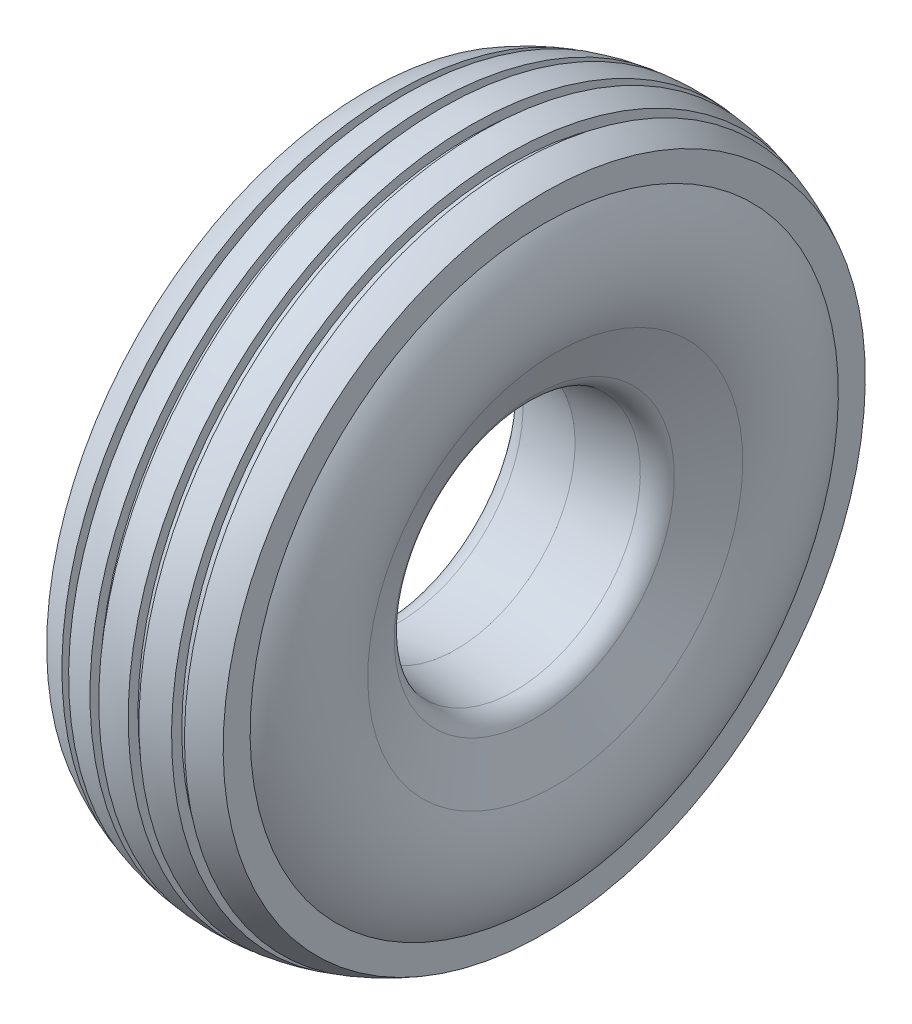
ISO-10303-21;
HEADER;
FILE_DESCRIPTION(('STEP AP214'),'2;1');
FILE_NAME('part.step','',(''),(''),'','','');
FILE_SCHEMA(('AUTOMOTIVE_DESIGN { 1 0 10303 214 1 1 1 1 }'));
ENDSEC;
DATA;
#1=APPLICATION_CONTEXT('core data for automotive mechanical design processes');
#2=APPLICATION_PROTOCOL_DEFINITION('international standard','automotive_design',2000,#1);
#3=PRODUCT_CONTEXT('',#1,'mechanical');
#4=PRODUCT('Part','Part','',(#3));
#5=PRODUCT_RELATED_PRODUCT_CATEGORY('part','',(#4));
#6=PRODUCT_DEFINITION_FORMATION('','',#4);
#7=PRODUCT_DEFINITION_CONTEXT('part definition',#1,'design');
#8=PRODUCT_DEFINITION('design','',#6,#7);
#9=PRODUCT_DEFINITION_SHAPE('','',#8);
#10=(LENGTH_UNIT() NAMED_UNIT(*) SI_UNIT(.MILLI.,.METRE.));
#11=(NAMED_UNIT(*) PLANE_ANGLE_UNIT() SI_UNIT($,.RADIAN.));
#12=(NAMED_UNIT(*) SI_UNIT($,.STERADIAN.) SOLID_ANGLE_UNIT());
#13=UNCERTAINTY_MEASURE_WITH_UNIT(LENGTH_MEASURE(1.E-05),#10,'distance_accuracy_value','');
#14=(GEOMETRIC_REPRESENTATION_CONTEXT(3) GLOBAL_UNCERTAINTY_ASSIGNED_CONTEXT((#13)) GLOBAL_UNIT_ASSIGNED_CONTEXT((#10,
#11,#12)) REPRESENTATION_CONTEXT('',''));
#15=CARTESIAN_POINT('',(0.,0.,0.));
#16=DIRECTION('',(0.,0.,1.));
#17=DIRECTION('',(1.,0.,0.));
#18=AXIS2_PLACEMENT_3D('',#15,#16,#17);
#19=CARTESIAN_POINT('',(-0.184596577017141,0.,0.));
#20=DIRECTION('',(1.,0.,0.));
#21=DIRECTION('',(0.,1.,0.));
#22=AXIS2_PLACEMENT_3D('',#19,#20,#21);
#23=TOROIDAL_SURFACE('',#22,47.1656479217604,21.9569850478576);
#24=CARTESIAN_POINT('',(-20.25,0.,0.));
#25=DIRECTION('',(1.,0.,0.));
#26=DIRECTION('',(0.,1.,0.));
#27=AXIS2_PLACEMENT_3D('',#24,#25,#26);
#28=CIRCLE('',#27,38.25);
#29=CARTESIAN_POINT('',(-20.25,38.25,0.));
#30=VERTEX_POINT('',#29);
#31=EDGE_CURVE('E159',#30,#30,#28,.T.);
#32=ORIENTED_EDGE('',*,*,#31,.T.);
#33=EDGE_LOOP('',(#32));
#34=FACE_BOUND('',#33,.T.);
#35=CARTESIAN_POINT('',(-18.,0.,0.));
#36=DIRECTION('',(1.,0.,0.));
#37=DIRECTION('',(0.,1.,0.));
#38=AXIS2_PLACEMENT_3D('',#35,#36,#37);
#39=CIRCLE('',#38,60.);
#40=CARTESIAN_POINT('',(-18.,60.,0.));
#41=VERTEX_POINT('',#40);
#42=EDGE_CURVE('E81',#41,#41,#39,.T.);
#43=ORIENTED_EDGE('',*,*,#42,.F.);
#44=EDGE_LOOP('',(#43));
#45=FACE_BOUND('',#44,.T.);
#46=ADVANCED_FACE('F45',(#34,#45),#23,.T.);
#47=CARTESIAN_POINT('',(-18.,60.,0.));
#48=DIRECTION('',(-1.,0.,0.));
#49=DIRECTION('',(0.,-1.,0.));
#50=AXIS2_PLACEMENT_3D('',#47,#48,#49);
#51=PLANE('',#50);
#52=ORIENTED_EDGE('',*,*,#42,.T.);
#53=EDGE_LOOP('',(#52));
#54=FACE_BOUND('',#53,.T.);
#55=CARTESIAN_POINT('',(-18.,0.,0.));
#56=DIRECTION('',(1.,0.,0.));
#57=DIRECTION('',(0.,1.,0.));
#58=AXIS2_PLACEMENT_3D('',#55,#56,#57);
#59=CIRCLE('',#58,65.5);
#60=CARTESIAN_POINT('',(-18.,65.5,0.));
#61=VERTEX_POINT('',#60);
#62=EDGE_CURVE('E84',#61,#61,#59,.T.);
#63=ORIENTED_EDGE('',*,*,#62,.F.);
#64=EDGE_LOOP('',(#63));
#65=FACE_BOUND('',#64,.T.);
#66=ADVANCED_FACE('F178',(#54,#65),#51,.T.);
#67=CARTESIAN_POINT('',(0.,0.,0.));
#68=DIRECTION('',(1.,0.,0.));
#69=DIRECTION('',(0.,1.,0.));
#70=AXIS2_PLACEMENT_3D('',#67,#68,#69);
#71=DEGENERATE_TOROIDAL_SURFACE('',#70,31.7500000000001,38.25,.T.);
#72=ORIENTED_EDGE('',*,*,#62,.T.);
#73=EDGE_LOOP('',(#72));
#74=FACE_BOUND('',#73,.T.);
#75=CARTESIAN_POINT('',(-12.5,0.,0.));
#76=DIRECTION('',(1.,0.,0.));
#77=DIRECTION('',(0.,1.,0.));
#78=AXIS2_PLACEMENT_3D('',#75,#76,#77);
#79=CIRCLE('',#78,67.899861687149);
#80=CARTESIAN_POINT('',(-12.5,67.899861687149,0.));
#81=VERTEX_POINT('',#80);
#82=EDGE_CURVE('E87',#81,#81,#79,.T.);
#83=ORIENTED_EDGE('',*,*,#82,.F.);
#84=EDGE_LOOP('',(#83));
#85=FACE_BOUND('',#84,.T.);
#86=ADVANCED_FACE('F183',(#74,#85),#71,.T.);
#87=CARTESIAN_POINT('',(-12.5,67.899861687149,0.));
#88=DIRECTION('',(1.,0.,0.));
#89=DIRECTION('',(0.,1.,0.));
#90=AXIS2_PLACEMENT_3D('',#87,#88,#89);
#91=PLANE('',#90);
#92=ORIENTED_EDGE('',*,*,#82,.T.);
#93=EDGE_LOOP('',(#92));
#94=FACE_BOUND('',#93,.T.);
#95=CARTESIAN_POINT('',(-12.5,0.,0.));
#96=DIRECTION('',(1.,0.,0.));
#97=DIRECTION('',(0.,1.,0.));
#98=AXIS2_PLACEMENT_3D('',#95,#96,#97);
#99=CIRCLE('',#98,65.7766439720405);
#100=CARTESIAN_POINT('',(-12.5,65.7766439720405,0.));
#101=VERTEX_POINT('',#100);
#102=EDGE_CURVE('E90',#101,#101,#99,.T.);
#103=ORIENTED_EDGE('',*,*,#102,.F.);
#104=EDGE_LOOP('',(#103));
#105=FACE_BOUND('',#104,.T.);
#106=ADVANCED_FACE('F503',(#94,#105),#91,.T.);
#107=CARTESIAN_POINT('',(0.,0.,0.));
#108=DIRECTION('',(1.,0.,0.));
#109=DIRECTION('',(0.,1.,0.));
#110=AXIS2_PLACEMENT_3D('',#107,#108,#109);
#111=DEGENERATE_TOROIDAL_SURFACE('',#110,31.7500000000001,36.25,.T.);
#112=ORIENTED_EDGE('',*,*,#102,.T.);
#113=EDGE_LOOP('',(#112));
#114=FACE_BOUND('',#113,.T.);
#115=CARTESIAN_POINT('',(-10.5,0.,0.));
#116=DIRECTION('',(1.,0.,0.));
#117=DIRECTION('',(0.,1.,0.));
#118=AXIS2_PLACEMENT_3D('',#115,#116,#117);
#119=CIRCLE('',#118,66.4460012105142);
#120=CARTESIAN_POINT('',(-10.5,66.4460012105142,0.));
#121=VERTEX_POINT('',#120);
#122=EDGE_CURVE('E93',#121,#121,#119,.T.);
#123=ORIENTED_EDGE('',*,*,#122,.F.);
#124=EDGE_LOOP('',(#123));
#125=FACE_BOUND('',#124,.T.);
#126=ADVANCED_FACE('F493',(#114,#125),#111,.T.);
#127=CARTESIAN_POINT('',(-10.5,68.5305995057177,0.));
#128=DIRECTION('',(-1.,0.,0.));
#129=DIRECTION('',(0.,-1.,0.));
#130=AXIS2_PLACEMENT_3D('',#127,#128,#129);
#131=PLANE('',#130);
#132=ORIENTED_EDGE('',*,*,#122,.T.);
#133=EDGE_LOOP('',(#132));
#134=FACE_BOUND('',#133,.T.);
#135=CARTESIAN_POINT('',(-10.5,0.,0.));
#136=DIRECTION('',(1.,0.,0.));
#137=DIRECTION('',(0.,1.,0.));
#138=AXIS2_PLACEMENT_3D('',#135,#136,#137);
#139=CIRCLE('',#138,68.5305995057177);
#140=CARTESIAN_POINT('',(-10.5,68.5305995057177,0.));
#141=VERTEX_POINT('',#140);
#142=EDGE_CURVE('E96',#141,#141,#139,.T.);
#143=ORIENTED_EDGE('',*,*,#142,.F.);
#144=EDGE_LOOP('',(#143));
#145=FACE_BOUND('',#144,.T.);
#146=ADVANCED_FACE('F483',(#134,#145),#131,.T.);
#147=CARTESIAN_POINT('',(0.,0.,0.));
#148=DIRECTION('',(1.,0.,0.));
#149=DIRECTION('',(0.,1.,0.));
#150=AXIS2_PLACEMENT_3D('',#147,#148,#149);
#151=DEGENERATE_TOROIDAL_SURFACE('',#150,31.7500000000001,38.25,.T.);
#152=ORIENTED_EDGE('',*,*,#142,.T.);
#153=EDGE_LOOP('',(#152));
#154=FACE_BOUND('',#153,.T.);
#155=CARTESIAN_POINT('',(-5.00000000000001,0.,0.));
#156=DIRECTION('',(1.,0.,0.));
#157=DIRECTION('',(0.,1.,0.));
#158=AXIS2_PLACEMENT_3D('',#155,#156,#157);
#159=CIRCLE('',#158,69.6717945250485);
#160=CARTESIAN_POINT('',(-5.00000000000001,69.6717945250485,0.));
#161=VERTEX_POINT('',#160);
#162=EDGE_CURVE('E99',#161,#161,#159,.T.);
#163=ORIENTED_EDGE('',*,*,#162,.F.);
#164=EDGE_LOOP('',(#163));
#165=FACE_BOUND('',#164,.T.);
#166=ADVANCED_FACE('F473',(#154,#165),#151,.T.);
#167=CARTESIAN_POINT('',(-5.00000000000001,69.6717945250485,0.));
#168=DIRECTION('',(1.,0.,0.));
#169=DIRECTION('',(0.,1.,0.));
#170=AXIS2_PLACEMENT_3D('',#167,#168,#169);
#171=PLANE('',#170);
#172=ORIENTED_EDGE('',*,*,#162,.T.);
#173=EDGE_LOOP('',(#172));
#174=FACE_BOUND('',#173,.T.);
#175=CARTESIAN_POINT('',(-5.00000000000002,0.,0.));
#176=DIRECTION('',(1.,0.,0.));
#177=DIRECTION('',(0.,1.,0.));
#178=AXIS2_PLACEMENT_3D('',#175,#176,#177);
#179=CIRCLE('',#178,67.6535165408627);
#180=CARTESIAN_POINT('',(-5.00000000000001,67.6535165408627,0.));
#181=VERTEX_POINT('',#180);
#182=EDGE_CURVE('E102',#181,#181,#179,.T.);
#183=ORIENTED_EDGE('',*,*,#182,.F.);
#184=EDGE_LOOP('',(#183));
#185=FACE_BOUND('',#184,.T.);
#186=ADVANCED_FACE('F463',(#174,#185),#171,.T.);
#187=CARTESIAN_POINT('',(0.,0.,0.));
#188=DIRECTION('',(1.,0.,0.));
#189=DIRECTION('',(0.,1.,0.));
#190=AXIS2_PLACEMENT_3D('',#187,#188,#189);
#191=DEGENERATE_TOROIDAL_SURFACE('',#190,31.7500000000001,36.25,.T.);
#192=ORIENTED_EDGE('',*,*,#182,.T.);
#193=EDGE_LOOP('',(#192));
#194=FACE_BOUND('',#193,.T.);
#195=CARTESIAN_POINT('',(-3.00000000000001,0.,0.));
#196=DIRECTION('',(1.,0.,0.));
#197=DIRECTION('',(0.,1.,0.));
#198=AXIS2_PLACEMENT_3D('',#195,#196,#197);
#199=CIRCLE('',#198,67.8756487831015);
#200=CARTESIAN_POINT('',(-3.00000000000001,67.8756487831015,0.));
#201=VERTEX_POINT('',#200);
#202=EDGE_CURVE('E105',#201,#201,#199,.T.);
#203=ORIENTED_EDGE('',*,*,#202,.F.);
#204=EDGE_LOOP('',(#203));
#205=FACE_BOUND('',#204,.T.);
#206=ADVANCED_FACE('F453',(#194,#205),#191,.T.);
#207=CARTESIAN_POINT('',(-3.00000000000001,69.8821714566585,0.));
#208=DIRECTION('',(-1.,0.,0.));
#209=DIRECTION('',(0.,-1.,0.));
#210=AXIS2_PLACEMENT_3D('',#207,#208,#209);
#211=PLANE('',#210);
#212=ORIENTED_EDGE('',*,*,#202,.T.);
#213=EDGE_LOOP('',(#212));
#214=FACE_BOUND('',#213,.T.);
#215=CARTESIAN_POINT('',(-3.00000000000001,0.,0.));
#216=DIRECTION('',(1.,0.,0.));
#217=DIRECTION('',(0.,1.,0.));
#218=AXIS2_PLACEMENT_3D('',#215,#216,#217);
#219=CIRCLE('',#218,69.8821714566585);
#220=CARTESIAN_POINT('',(-3.00000000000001,69.8821714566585,0.));
#221=VERTEX_POINT('',#220);
#222=EDGE_CURVE('E108',#221,#221,#219,.T.);
#223=ORIENTED_EDGE('',*,*,#222,.F.);
#224=EDGE_LOOP('',(#223));
#225=FACE_BOUND('',#224,.T.);
#226=ADVANCED_FACE('F443',(#214,#225),#211,.T.);
#227=CARTESIAN_POINT('',(0.,0.,0.));
#228=DIRECTION('',(1.,0.,0.));
#229=DIRECTION('',(0.,1.,0.));
#230=AXIS2_PLACEMENT_3D('',#227,#228,#229);
#231=DEGENERATE_TOROIDAL_SURFACE('',#230,31.7500000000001,38.25,.T.);
#232=ORIENTED_EDGE('',*,*,#222,.T.);
#233=EDGE_LOOP('',(#232));
#234=FACE_BOUND('',#233,.T.);
#235=CARTESIAN_POINT('',(2.99999999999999,0.,0.));
#236=DIRECTION('',(1.,0.,0.));
#237=DIRECTION('',(0.,1.,0.));
#238=AXIS2_PLACEMENT_3D('',#235,#236,#237);
#239=CIRCLE('',#238,69.8821714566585);
#240=CARTESIAN_POINT('',(3.,69.8821714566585,0.));
#241=VERTEX_POINT('',#240);
#242=EDGE_CURVE('E111',#241,#241,#239,.T.);
#243=ORIENTED_EDGE('',*,*,#242,.F.);
#244=EDGE_LOOP('',(#243));
#245=FACE_BOUND('',#244,.T.);
#246=ADVANCED_FACE('F433',(#234,#245),#231,.T.);
#247=CARTESIAN_POINT('',(3.,69.8821714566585,0.));
#248=DIRECTION('',(1.,0.,0.));
#249=DIRECTION('',(0.,1.,0.));
#250=AXIS2_PLACEMENT_3D('',#247,#248,#249);
#251=PLANE('',#250);
#252=ORIENTED_EDGE('',*,*,#242,.T.);
#253=EDGE_LOOP('',(#252));
#254=FACE_BOUND('',#253,.T.);
#255=CARTESIAN_POINT('',(2.99999999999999,0.,0.));
#256=DIRECTION('',(1.,0.,0.));
#257=DIRECTION('',(0.,1.,0.));
#258=AXIS2_PLACEMENT_3D('',#255,#256,#257);
#259=CIRCLE('',#258,67.8756487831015);
#260=CARTESIAN_POINT('',(3.,67.8756487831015,0.));
#261=VERTEX_POINT('',#260);
#262=EDGE_CURVE('E114',#261,#261,#259,.T.);
#263=ORIENTED_EDGE('',*,*,#262,.F.);
#264=EDGE_LOOP('',(#263));
#265=FACE_BOUND('',#264,.T.);
#266=ADVANCED_FACE('F423',(#254,#265),#251,.T.);
#267=CARTESIAN_POINT('',(0.,0.,0.));
#268=DIRECTION('',(1.,0.,0.));
#269=DIRECTION('',(0.,1.,0.));
#270=AXIS2_PLACEMENT_3D('',#267,#268,#269);
#271=DEGENERATE_TOROIDAL_SURFACE('',#270,31.7500000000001,36.25,.T.);
#272=ORIENTED_EDGE('',*,*,#262,.T.);
#273=EDGE_LOOP('',(#272));
#274=FACE_BOUND('',#273,.T.);
#275=CARTESIAN_POINT('',(4.99999999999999,0.,0.));
#276=DIRECTION('',(1.,0.,0.));
#277=DIRECTION('',(0.,1.,0.));
#278=AXIS2_PLACEMENT_3D('',#275,#276,#277);
#279=CIRCLE('',#278,67.6535165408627);
#280=CARTESIAN_POINT('',(4.99999999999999,67.6535165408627,0.));
#281=VERTEX_POINT('',#280);
#282=EDGE_CURVE('E117',#281,#281,#279,.T.);
#283=ORIENTED_EDGE('',*,*,#282,.F.);
#284=EDGE_LOOP('',(#283));
#285=FACE_BOUND('',#284,.T.);
#286=ADVANCED_FACE('F413',(#274,#285),#271,.T.);
#287=CARTESIAN_POINT('',(4.99999999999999,69.6717945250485,0.));
#288=DIRECTION('',(-1.,0.,0.));
#289=DIRECTION('',(0.,-1.,0.));
#290=AXIS2_PLACEMENT_3D('',#287,#288,#289);
#291=PLANE('',#290);
#292=ORIENTED_EDGE('',*,*,#282,.T.);
#293=EDGE_LOOP('',(#292));
#294=FACE_BOUND('',#293,.T.);
#295=CARTESIAN_POINT('',(4.99999999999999,0.,0.));
#296=DIRECTION('',(1.,0.,0.));
#297=DIRECTION('',(0.,1.,0.));
#298=AXIS2_PLACEMENT_3D('',#295,#296,#297);
#299=CIRCLE('',#298,69.6717945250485);
#300=CARTESIAN_POINT('',(4.99999999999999,69.6717945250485,0.));
#301=VERTEX_POINT('',#300);
#302=EDGE_CURVE('E120',#301,#301,#299,.T.);
#303=ORIENTED_EDGE('',*,*,#302,.F.);
#304=EDGE_LOOP('',(#303));
#305=FACE_BOUND('',#304,.T.);
#306=ADVANCED_FACE('F403',(#294,#305),#291,.T.);
#307=CARTESIAN_POINT('',(0.,0.,0.));
#308=DIRECTION('',(1.,0.,0.));
#309=DIRECTION('',(0.,1.,0.));
#310=AXIS2_PLACEMENT_3D('',#307,#308,#309);
#311=DEGENERATE_TOROIDAL_SURFACE('',#310,31.7500000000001,38.25,.T.);
#312=ORIENTED_EDGE('',*,*,#302,.T.);
#313=EDGE_LOOP('',(#312));
#314=FACE_BOUND('',#313,.T.);
#315=CARTESIAN_POINT('',(10.5,0.,0.));
#316=DIRECTION('',(1.,0.,0.));
#317=DIRECTION('',(0.,1.,0.));
#318=AXIS2_PLACEMENT_3D('',#315,#316,#317);
#319=CIRCLE('',#318,68.5305995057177);
#320=CARTESIAN_POINT('',(10.5,68.5305995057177,0.));
#321=VERTEX_POINT('',#320);
#322=EDGE_CURVE('E123',#321,#321,#319,.T.);
#323=ORIENTED_EDGE('',*,*,#322,.F.);
#324=EDGE_LOOP('',(#323));
#325=FACE_BOUND('',#324,.T.);
#326=ADVANCED_FACE('F393',(#314,#325),#311,.T.);
#327=CARTESIAN_POINT('',(10.5,68.5305995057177,0.));
#328=DIRECTION('',(1.,0.,0.));
#329=DIRECTION('',(0.,1.,0.));
#330=AXIS2_PLACEMENT_3D('',#327,#328,#329);
#331=PLANE('',#330);
#332=ORIENTED_EDGE('',*,*,#322,.T.);
#333=EDGE_LOOP('',(#332));
#334=FACE_BOUND('',#333,.T.);
#335=CARTESIAN_POINT('',(10.5,0.,0.));
#336=DIRECTION('',(1.,0.,0.));
#337=DIRECTION('',(0.,1.,0.));
#338=AXIS2_PLACEMENT_3D('',#335,#336,#337);
#339=CIRCLE('',#338,66.4460012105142);
#340=CARTESIAN_POINT('',(10.5,66.4460012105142,0.));
#341=VERTEX_POINT('',#340);
#342=EDGE_CURVE('E126',#341,#341,#339,.T.);
#343=ORIENTED_EDGE('',*,*,#342,.F.);
#344=EDGE_LOOP('',(#343));
#345=FACE_BOUND('',#344,.T.);
#346=ADVANCED_FACE('F383',(#334,#345),#331,.T.);
#347=CARTESIAN_POINT('',(0.,0.,0.));
#348=DIRECTION('',(1.,0.,0.));
#349=DIRECTION('',(0.,1.,0.));
#350=AXIS2_PLACEMENT_3D('',#347,#348,#349);
#351=DEGENERATE_TOROIDAL_SURFACE('',#350,31.7500000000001,36.25,.T.);
#352=ORIENTED_EDGE('',*,*,#342,.T.);
#353=EDGE_LOOP('',(#352));
#354=FACE_BOUND('',#353,.T.);
#355=CARTESIAN_POINT('',(12.5,0.,0.));
#356=DIRECTION('',(1.,0.,0.));
#357=DIRECTION('',(0.,1.,0.));
#358=AXIS2_PLACEMENT_3D('',#355,#356,#357);
#359=CIRCLE('',#358,65.7766439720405);
#360=CARTESIAN_POINT('',(12.5,65.7766439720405,0.));
#361=VERTEX_POINT('',#360);
#362=EDGE_CURVE('E129',#361,#361,#359,.T.);
#363=ORIENTED_EDGE('',*,*,#362,.F.);
#364=EDGE_LOOP('',(#363));
#365=FACE_BOUND('',#364,.T.);
#366=ADVANCED_FACE('F373',(#354,#365),#351,.T.);
#367=CARTESIAN_POINT('',(12.5,67.899861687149,0.));
#368=DIRECTION('',(-1.,0.,0.));
#369=DIRECTION('',(0.,-1.,0.));
#370=AXIS2_PLACEMENT_3D('',#367,#368,#369);
#371=PLANE('',#370);
#372=ORIENTED_EDGE('',*,*,#362,.T.);
#373=EDGE_LOOP('',(#372));
#374=FACE_BOUND('',#373,.T.);
#375=CARTESIAN_POINT('',(12.5,0.,0.));
#376=DIRECTION('',(1.,0.,0.));
#377=DIRECTION('',(0.,1.,0.));
#378=AXIS2_PLACEMENT_3D('',#375,#376,#377);
#379=CIRCLE('',#378,67.899861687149);
#380=CARTESIAN_POINT('',(12.5,67.899861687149,0.));
#381=VERTEX_POINT('',#380);
#382=EDGE_CURVE('E132',#381,#381,#379,.T.);
#383=ORIENTED_EDGE('',*,*,#382,.F.);
#384=EDGE_LOOP('',(#383));
#385=FACE_BOUND('',#384,.T.);
#386=ADVANCED_FACE('F363',(#374,#385),#371,.T.);
#387=CARTESIAN_POINT('',(0.,0.,0.));
#388=DIRECTION('',(1.,0.,0.));
#389=DIRECTION('',(0.,1.,0.));
#390=AXIS2_PLACEMENT_3D('',#387,#388,#389);
#391=DEGENERATE_TOROIDAL_SURFACE('',#390,31.7500000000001,38.25,.T.);
#392=ORIENTED_EDGE('',*,*,#382,.T.);
#393=EDGE_LOOP('',(#392));
#394=FACE_BOUND('',#393,.T.);
#395=CARTESIAN_POINT('',(18.,0.,0.));
#396=DIRECTION('',(1.,0.,0.));
#397=DIRECTION('',(0.,1.,0.));
#398=AXIS2_PLACEMENT_3D('',#395,#396,#397);
#399=CIRCLE('',#398,65.5);
#400=CARTESIAN_POINT('',(18.,65.5,0.));
#401=VERTEX_POINT('',#400);
#402=EDGE_CURVE('E135',#401,#401,#399,.T.);
#403=ORIENTED_EDGE('',*,*,#402,.F.);
#404=EDGE_LOOP('',(#403));
#405=FACE_BOUND('',#404,.T.);
#406=ADVANCED_FACE('F353',(#394,#405),#391,.T.);
#407=CARTESIAN_POINT('',(18.,60.,0.));
#408=DIRECTION('',(1.,0.,0.));
#409=DIRECTION('',(0.,1.,0.));
#410=AXIS2_PLACEMENT_3D('',#407,#408,#409);
#411=PLANE('',#410);
#412=ORIENTED_EDGE('',*,*,#402,.T.);
#413=EDGE_LOOP('',(#412));
#414=FACE_BOUND('',#413,.T.);
#415=CARTESIAN_POINT('',(18.,0.,0.));
#416=DIRECTION('',(1.,0.,0.));
#417=DIRECTION('',(0.,1.,0.));
#418=AXIS2_PLACEMENT_3D('',#415,#416,#417);
#419=CIRCLE('',#418,60.);
#420=CARTESIAN_POINT('',(18.,60.,0.));
#421=VERTEX_POINT('',#420);
#422=EDGE_CURVE('E138',#421,#421,#419,.T.);
#423=ORIENTED_EDGE('',*,*,#422,.F.);
#424=EDGE_LOOP('',(#423));
#425=FACE_BOUND('',#424,.T.);
#426=ADVANCED_FACE('F343',(#414,#425),#411,.T.);
#427=CARTESIAN_POINT('',(0.184596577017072,0.,0.));
#428=DIRECTION('',(1.,0.,0.));
#429=DIRECTION('',(0.,1.,0.));
#430=AXIS2_PLACEMENT_3D('',#427,#428,#429);
#431=TOROIDAL_SURFACE('',#430,47.1656479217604,21.9569850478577);
#432=ORIENTED_EDGE('',*,*,#422,.T.);
#433=EDGE_LOOP('',(#432));
#434=FACE_BOUND('',#433,.T.);
#435=CARTESIAN_POINT('',(20.25,0.,0.));
#436=DIRECTION('',(1.,0.,0.));
#437=DIRECTION('',(0.,1.,0.));
#438=AXIS2_PLACEMENT_3D('',#435,#436,#437);
#439=CIRCLE('',#438,38.25);
#440=CARTESIAN_POINT('',(20.25,38.25,0.));
#441=VERTEX_POINT('',#440);
#442=EDGE_CURVE('E141',#441,#441,#439,.T.);
#443=ORIENTED_EDGE('',*,*,#442,.F.);
#444=EDGE_LOOP('',(#443));
#445=FACE_BOUND('',#444,.T.);
#446=ADVANCED_FACE('F333',(#434,#445),#431,.T.);
#447=CARTESIAN_POINT('',(15.9587088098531,0.,0.));
#448=DIRECTION('',(1.,0.,0.));
#449=DIRECTION('',(0.,1.,0.));
#450=AXIS2_PLACEMENT_3D('',#447,#448,#449);
#451=CONICAL_SURFACE('',#450,28.5920940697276,1.15266810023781);
#452=ORIENTED_EDGE('',*,*,#442,.T.);
#453=EDGE_LOOP('',(#452));
#454=FACE_BOUND('',#453,.T.);
#455=CARTESIAN_POINT('',(15.9587088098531,0.,0.));
#456=DIRECTION('',(1.,0.,0.));
#457=DIRECTION('',(0.,1.,0.));
#458=AXIS2_PLACEMENT_3D('',#455,#456,#457);
#459=CIRCLE('',#458,28.5920940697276);
#460=CARTESIAN_POINT('',(15.9587088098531,28.5920940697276,0.));
#461=VERTEX_POINT('',#460);
#462=EDGE_CURVE('E144',#461,#461,#459,.T.);
#463=ORIENTED_EDGE('',*,*,#462,.F.);
#464=EDGE_LOOP('',(#463));
#465=FACE_BOUND('',#464,.T.);
#466=ADVANCED_FACE('F323',(#454,#465),#451,.F.);
#467=CARTESIAN_POINT('',(11.3894559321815,0.,0.));
#468=DIRECTION('',(1.,0.,0.));
#469=DIRECTION('',(0.,1.,0.));
#470=AXIS2_PLACEMENT_3D('',#467,#468,#469);
#471=TOROIDAL_SURFACE('',#470,30.6223472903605,5.);
#472=ORIENTED_EDGE('',*,*,#462,.T.);
#473=EDGE_LOOP('',(#472));
#474=FACE_BOUND('',#473,.T.);
#475=CARTESIAN_POINT('',(11.9523266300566,0.,0.));
#476=DIRECTION('',(1.,0.,0.));
#477=DIRECTION('',(0.,1.,0.));
#478=AXIS2_PLACEMENT_3D('',#475,#476,#477);
#479=CIRCLE('',#478,25.6541306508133);
#480=CARTESIAN_POINT('',(11.9523266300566,25.6541306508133,0.));
#481=VERTEX_POINT('',#480);
#482=EDGE_CURVE('E147',#481,#481,#479,.T.);
#483=ORIENTED_EDGE('',*,*,#482,.F.);
#484=EDGE_LOOP('',(#483));
#485=FACE_BOUND('',#484,.T.);
#486=ADVANCED_FACE('F313',(#474,#485),#471,.T.);
#487=CARTESIAN_POINT('',(0.,0.,0.));
#488=DIRECTION('',(1.,0.,0.));
#489=DIRECTION('',(0.,1.,0.));
#490=AXIS2_PLACEMENT_3D('',#487,#488,#489);
#491=CONICAL_SURFACE('',#490,24.3,0.1128132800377);
#492=ORIENTED_EDGE('',*,*,#482,.T.);
#493=EDGE_LOOP('',(#492));
#494=FACE_BOUND('',#493,.T.);
#495=CARTESIAN_POINT('',(0.,0.,0.));
#496=DIRECTION('',(1.,0.,0.));
#497=DIRECTION('',(0.,1.,0.));
#498=AXIS2_PLACEMENT_3D('',#495,#496,#497);
#499=CIRCLE('',#498,24.3);
#500=CARTESIAN_POINT('',(0.,24.3,0.));
#501=VERTEX_POINT('',#500);
#502=EDGE_CURVE('E150',#501,#501,#499,.T.);
#503=ORIENTED_EDGE('',*,*,#502,.F.);
#504=EDGE_LOOP('',(#503));
#505=FACE_BOUND('',#504,.T.);
#506=ADVANCED_FACE('F303',(#494,#505),#491,.F.);
#507=CARTESIAN_POINT('',(-11.9523266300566,0.,0.));
#508=DIRECTION('',(-1.,0.,0.));
#509=DIRECTION('',(0.,-1.,0.));
#510=AXIS2_PLACEMENT_3D('',#507,#508,#509);
#511=CONICAL_SURFACE('',#510,25.6541306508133,0.112813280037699);
#512=ORIENTED_EDGE('',*,*,#502,.T.);
#513=EDGE_LOOP('',(#512));
#514=FACE_BOUND('',#513,.T.);
#515=CARTESIAN_POINT('',(-11.9523266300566,0.,0.));
#516=DIRECTION('',(1.,0.,0.));
#517=DIRECTION('',(0.,1.,0.));
#518=AXIS2_PLACEMENT_3D('',#515,#516,#517);
#519=CIRCLE('',#518,25.6541306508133);
#520=CARTESIAN_POINT('',(-11.9523266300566,25.6541306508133,0.));
#521=VERTEX_POINT('',#520);
#522=EDGE_CURVE('E153',#521,#521,#519,.T.);
#523=ORIENTED_EDGE('',*,*,#522,.F.);
#524=EDGE_LOOP('',(#523));
#525=FACE_BOUND('',#524,.T.);
#526=ADVANCED_FACE('F174',(#514,#525),#511,.F.);
#527=CARTESIAN_POINT('',(-11.3894559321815,0.,0.));
#528=DIRECTION('',(1.,0.,0.));
#529=DIRECTION('',(0.,1.,0.));
#530=AXIS2_PLACEMENT_3D('',#527,#528,#529);
#531=TOROIDAL_SURFACE('',#530,30.6223472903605,5.);
#532=ORIENTED_EDGE('',*,*,#522,.T.);
#533=EDGE_LOOP('',(#532));
#534=FACE_BOUND('',#533,.T.);
#535=CARTESIAN_POINT('',(-15.9587088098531,0.,0.));
#536=DIRECTION('',(1.,0.,0.));
#537=DIRECTION('',(0.,1.,0.));
#538=AXIS2_PLACEMENT_3D('',#535,#536,#537);
#539=CIRCLE('',#538,28.5920940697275);
#540=CARTESIAN_POINT('',(-15.9587088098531,28.5920940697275,0.));
#541=VERTEX_POINT('',#540);
#542=EDGE_CURVE('E156',#541,#541,#539,.T.);
#543=ORIENTED_EDGE('',*,*,#542,.F.);
#544=EDGE_LOOP('',(#543));
#545=FACE_BOUND('',#544,.T.);
#546=ADVANCED_FACE('F167',(#534,#545),#531,.T.);
#547=CARTESIAN_POINT('',(-20.25,0.,0.));
#548=DIRECTION('',(-1.,0.,0.));
#549=DIRECTION('',(0.,-1.,0.));
#550=AXIS2_PLACEMENT_3D('',#547,#548,#549);
#551=CONICAL_SURFACE('',#550,38.25,1.15266810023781);
#552=ORIENTED_EDGE('',*,*,#542,.T.);
#553=EDGE_LOOP('',(#552));
#554=FACE_BOUND('',#553,.T.);
#555=ORIENTED_EDGE('',*,*,#31,.F.);
#556=EDGE_LOOP('',(#555));
#557=FACE_BOUND('',#556,.T.);
#558=ADVANCED_FACE('F165',(#554,#557),#551,.F.);
#559=CLOSED_SHELL('',(#46,#66,#86,#106,#126,#146,#166,#186,#206,#226,#246,#266,#286,#306,#326,
#346,#366,#386,#406,#426,#446,#466,#486,#506,#526,#546,#558));
#560=CARTESIAN_POINT('',(-0.184596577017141,0.,0.));
#561=DIRECTION('',(1.,0.,0.));
#562=DIRECTION('',(0.,1.,0.));
#563=AXIS2_PLACEMENT_3D('',#560,#561,#562);
#564=TOROIDAL_SURFACE('',#563,47.1656479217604,15.9569850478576);
#565=CARTESIAN_POINT('',(-14.7668965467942,0.,0.));
#566=DIRECTION('',(1.,0.,0.));
#567=DIRECTION('',(0.,1.,0.));
#568=AXIS2_PLACEMENT_3D('',#565,#566,#567);
#569=CIRCLE('',#568,40.6863038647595);
#570=CARTESIAN_POINT('',(-14.7668965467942,40.6863038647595,0.));
#571=VERTEX_POINT('',#570);
#572=EDGE_CURVE('E12',#571,#571,#569,.T.);
#573=ORIENTED_EDGE('',*,*,#572,.F.);
#574=EDGE_LOOP('',(#573));
#575=FACE_BOUND('',#574,.T.);
#576=CARTESIAN_POINT('',(-12.,0.,0.));
#577=DIRECTION('',(1.,0.,0.));
#578=DIRECTION('',(0.,1.,0.));
#579=AXIS2_PLACEMENT_3D('',#576,#577,#578);
#580=CIRCLE('',#579,57.8904609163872);
#581=CARTESIAN_POINT('',(-12.,57.8904609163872,0.));
#582=VERTEX_POINT('',#581);
#583=EDGE_CURVE('E78',#582,#582,#580,.T.);
#584=ORIENTED_EDGE('',*,*,#583,.T.);
#585=EDGE_LOOP('',(#584));
#586=FACE_BOUND('',#585,.T.);
#587=ADVANCED_FACE('F47',(#575,#586),#564,.F.);
#588=CARTESIAN_POINT('',(-14.7668965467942,0.,0.));
#589=DIRECTION('',(-1.,0.,0.));
#590=DIRECTION('',(0.,-1.,0.));
#591=AXIS2_PLACEMENT_3D('',#588,#589,#590);
#592=CONICAL_SURFACE('',#591,40.6863038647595,1.15266810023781);
#593=CARTESIAN_POINT('',(-10.7080553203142,0.,0.));
#594=DIRECTION('',(1.,0.,0.));
#595=DIRECTION('',(0.,1.,0.));
#596=AXIS2_PLACEMENT_3D('',#593,#594,#595);
#597=CIRCLE('',#596,31.5515458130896);
#598=CARTESIAN_POINT('',(-10.7080553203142,31.5515458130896,0.));
#599=VERTEX_POINT('',#598);
#600=EDGE_CURVE('E53',#599,#599,#597,.T.);
#601=ORIENTED_EDGE('',*,*,#600,.F.);
#602=EDGE_LOOP('',(#601));
#603=FACE_BOUND('',#602,.T.);
#604=ORIENTED_EDGE('',*,*,#572,.T.);
#605=EDGE_LOOP('',(#604));
#606=FACE_BOUND('',#605,.T.);
#607=ADVANCED_FACE('F215',(#603,#606),#592,.T.);
#608=CARTESIAN_POINT('',(-10.7080553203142,0.,0.));
#609=DIRECTION('',(-1.,0.,0.));
#610=DIRECTION('',(0.,-1.,0.));
#611=AXIS2_PLACEMENT_3D('',#608,#609,#610);
#612=CONICAL_SURFACE('',#611,31.5515458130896,0.112813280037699);
#613=CARTESIAN_POINT('',(0.,0.,0.));
#614=DIRECTION('',(1.,0.,0.));
#615=DIRECTION('',(0.,1.,0.));
#616=AXIS2_PLACEMENT_3D('',#613,#614,#615);
#617=CIRCLE('',#616,30.3383840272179);
#618=CARTESIAN_POINT('',(0.,30.3383840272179,0.));
#619=VERTEX_POINT('',#618);
#620=EDGE_CURVE('E57',#619,#619,#617,.T.);
#621=ORIENTED_EDGE('',*,*,#620,.F.);
#622=EDGE_LOOP('',(#621));
#623=FACE_BOUND('',#622,.T.);
#624=ORIENTED_EDGE('',*,*,#600,.T.);
#625=EDGE_LOOP('',(#624));
#626=FACE_BOUND('',#625,.T.);
#627=ADVANCED_FACE('F212',(#623,#626),#612,.T.);
#628=CARTESIAN_POINT('',(0.,0.,0.));
#629=DIRECTION('',(1.,0.,0.));
#630=DIRECTION('',(0.,1.,0.));
#631=AXIS2_PLACEMENT_3D('',#628,#629,#630);
#632=CONICAL_SURFACE('',#631,30.3383840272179,0.1128132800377);
#633=CARTESIAN_POINT('',(10.7080553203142,0.,0.));
#634=DIRECTION('',(1.,0.,0.));
#635=DIRECTION('',(0.,1.,0.));
#636=AXIS2_PLACEMENT_3D('',#633,#634,#635);
#637=CIRCLE('',#636,31.5515458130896);
#638=CARTESIAN_POINT('',(10.7080553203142,31.5515458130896,0.));
#639=VERTEX_POINT('',#638);
#640=EDGE_CURVE('E61',#639,#639,#637,.T.);
#641=ORIENTED_EDGE('',*,*,#640,.F.);
#642=EDGE_LOOP('',(#641));
#643=FACE_BOUND('',#642,.T.);
#644=ORIENTED_EDGE('',*,*,#620,.T.);
#645=EDGE_LOOP('',(#644));
#646=FACE_BOUND('',#645,.T.);
#647=ADVANCED_FACE('F208',(#643,#646),#632,.T.);
#648=CARTESIAN_POINT('',(10.7080553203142,0.,0.));
#649=DIRECTION('',(1.,0.,0.));
#650=DIRECTION('',(0.,1.,0.));
#651=AXIS2_PLACEMENT_3D('',#648,#649,#650);
#652=CONICAL_SURFACE('',#651,31.5515458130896,1.15266810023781);
#653=CARTESIAN_POINT('',(14.7668965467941,0.,0.));
#654=DIRECTION('',(1.,0.,0.));
#655=DIRECTION('',(0.,1.,0.));
#656=AXIS2_PLACEMENT_3D('',#653,#654,#655);
#657=CIRCLE('',#656,40.6863038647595);
#658=CARTESIAN_POINT('',(14.7668965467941,40.6863038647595,0.));
#659=VERTEX_POINT('',#658);
#660=EDGE_CURVE('E66',#659,#659,#657,.T.);
#661=ORIENTED_EDGE('',*,*,#660,.F.);
#662=EDGE_LOOP('',(#661));
#663=FACE_BOUND('',#662,.T.);
#664=ORIENTED_EDGE('',*,*,#640,.T.);
#665=EDGE_LOOP('',(#664));
#666=FACE_BOUND('',#665,.T.);
#667=ADVANCED_FACE('F204',(#663,#666),#652,.T.);
#668=CARTESIAN_POINT('',(0.184596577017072,0.,0.));
#669=DIRECTION('',(1.,0.,0.));
#670=DIRECTION('',(0.,1.,0.));
#671=AXIS2_PLACEMENT_3D('',#668,#669,#670);
#672=TOROIDAL_SURFACE('',#671,47.1656479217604,15.9569850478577);
#673=CARTESIAN_POINT('',(12.,0.,0.));
#674=DIRECTION('',(1.,0.,0.));
#675=DIRECTION('',(0.,1.,0.));
#676=AXIS2_PLACEMENT_3D('',#673,#674,#675);
#677=CIRCLE('',#676,57.8904609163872);
#678=CARTESIAN_POINT('',(12.,57.8904609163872,0.));
#679=VERTEX_POINT('',#678);
#680=EDGE_CURVE('E69',#679,#679,#677,.T.);
#681=ORIENTED_EDGE('',*,*,#680,.F.);
#682=EDGE_LOOP('',(#681));
#683=FACE_BOUND('',#682,.T.);
#684=ORIENTED_EDGE('',*,*,#660,.T.);
#685=EDGE_LOOP('',(#684));
#686=FACE_BOUND('',#685,.T.);
#687=ADVANCED_FACE('F200',(#683,#686),#672,.F.);
#688=CARTESIAN_POINT('',(12.,57.8904609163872,0.));
#689=DIRECTION('',(1.,0.,0.));
#690=DIRECTION('',(0.,1.,0.));
#691=AXIS2_PLACEMENT_3D('',#688,#689,#690);
#692=PLANE('',#691);
#693=CARTESIAN_POINT('',(12.,0.,0.));
#694=DIRECTION('',(1.,0.,0.));
#695=DIRECTION('',(0.,1.,0.));
#696=AXIS2_PLACEMENT_3D('',#693,#694,#695);
#697=CIRCLE('',#696,59.518012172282);
#698=CARTESIAN_POINT('',(12.,59.518012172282,0.));
#699=VERTEX_POINT('',#698);
#700=EDGE_CURVE('E72',#699,#699,#697,.T.);
#701=ORIENTED_EDGE('',*,*,#700,.F.);
#702=EDGE_LOOP('',(#701));
#703=FACE_BOUND('',#702,.T.);
#704=ORIENTED_EDGE('',*,*,#680,.T.);
#705=EDGE_LOOP('',(#704));
#706=FACE_BOUND('',#705,.T.);
#707=ADVANCED_FACE('F196',(#703,#706),#692,.F.);
#708=CARTESIAN_POINT('',(0.,0.,0.));
#709=DIRECTION('',(1.,0.,0.));
#710=DIRECTION('',(0.,1.,0.));
#711=AXIS2_PLACEMENT_3D('',#708,#709,#710);
#712=TOROIDAL_SURFACE('',#711,31.7500000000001,30.25);
#713=CARTESIAN_POINT('',(-12.,0.,0.));
#714=DIRECTION('',(1.,0.,0.));
#715=DIRECTION('',(0.,1.,0.));
#716=AXIS2_PLACEMENT_3D('',#713,#714,#715);
#717=CIRCLE('',#716,59.518012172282);
#718=CARTESIAN_POINT('',(-12.,59.518012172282,0.));
#719=VERTEX_POINT('',#718);
#720=EDGE_CURVE('E75',#719,#719,#717,.T.);
#721=ORIENTED_EDGE('',*,*,#720,.F.);
#722=EDGE_LOOP('',(#721));
#723=FACE_BOUND('',#722,.T.);
#724=ORIENTED_EDGE('',*,*,#700,.T.);
#725=EDGE_LOOP('',(#724));
#726=FACE_BOUND('',#725,.T.);
#727=ADVANCED_FACE('F191',(#723,#726),#712,.F.);
#728=CARTESIAN_POINT('',(-12.,57.8904609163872,0.));
#729=DIRECTION('',(-1.,0.,0.));
#730=DIRECTION('',(0.,-1.,0.));
#731=AXIS2_PLACEMENT_3D('',#728,#729,#730);
#732=PLANE('',#731);
#733=ORIENTED_EDGE('',*,*,#583,.F.);
#734=EDGE_LOOP('',(#733));
#735=FACE_BOUND('',#734,.T.);
#736=ORIENTED_EDGE('',*,*,#720,.T.);
#737=EDGE_LOOP('',(#736));
#738=FACE_BOUND('',#737,.T.);
#739=ADVANCED_FACE('F188',(#735,#738),#732,.F.);
#740=CLOSED_SHELL('',(#587,#607,#627,#647,#667,#687,#707,#727,#739));
#741=ORIENTED_CLOSED_SHELL('',*,#740,.T.);
#742=BREP_WITH_VOIDS('B2',#559,(#741));
#743=ADVANCED_BREP_SHAPE_REPRESENTATION('',(#18,#742),#14);
#744=SHAPE_DEFINITION_REPRESENTATION(#9,#743);
ENDSEC;
END-ISO-10303-21;
